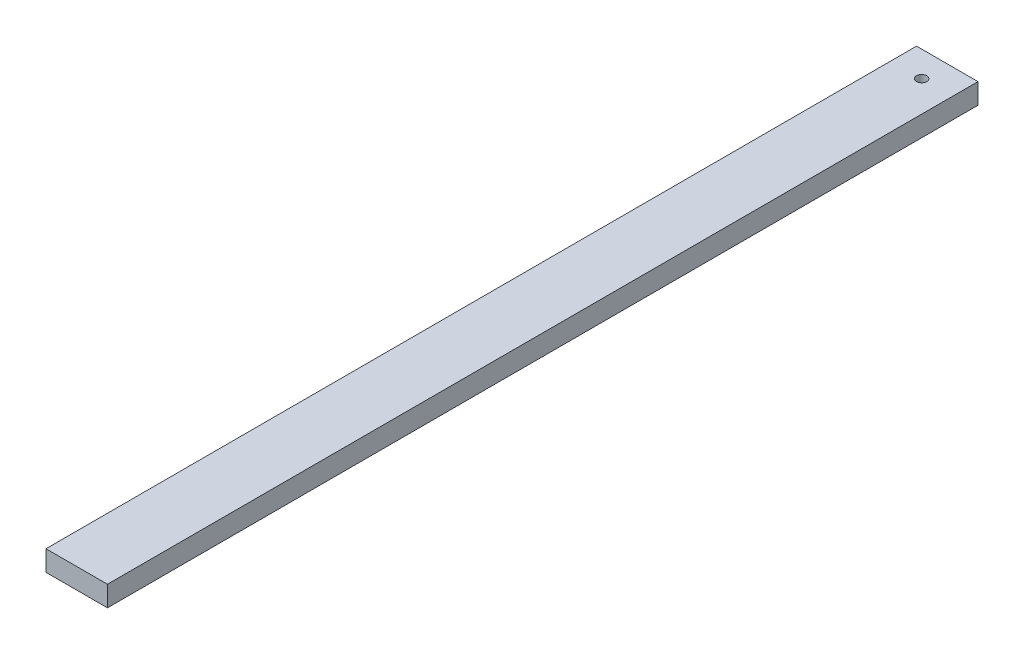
from build123d import *

# Parameters (mm, degrees)
ESQUISSE1_W                               = 60
ESQUISSE1_H                               = 20
BASE_EXTRUSION_DEPTH                      = 850
TROU_POUR_TARAUDAGE_POUR_TROU_TARAUD_M1_D = 10


with BuildPart() as part:
    # Esquisse1 → Base-Extrusion (new body)
    with BuildSketch(Plane.XY):
        with Locations((0, 10)):
            Rectangle(ESQUISSE1_W, ESQUISSE1_H)
    extrude(amount=BASE_EXTRUSION_DEPTH)

    # Trou pour taraudage pour trou taraud_ M1 (through all)
    with Locations(Plane(origin=(-710.721520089, -9.999999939, -1601.599138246), x_dir=(0, 0, 1), z_dir=(0, -1, 0))):
        with Locations((1626.599138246, -710.721517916)):
            Hole(TROU_POUR_TARAUDAGE_POUR_TROU_TARAUD_M1_D / 2)


solid = part.part
